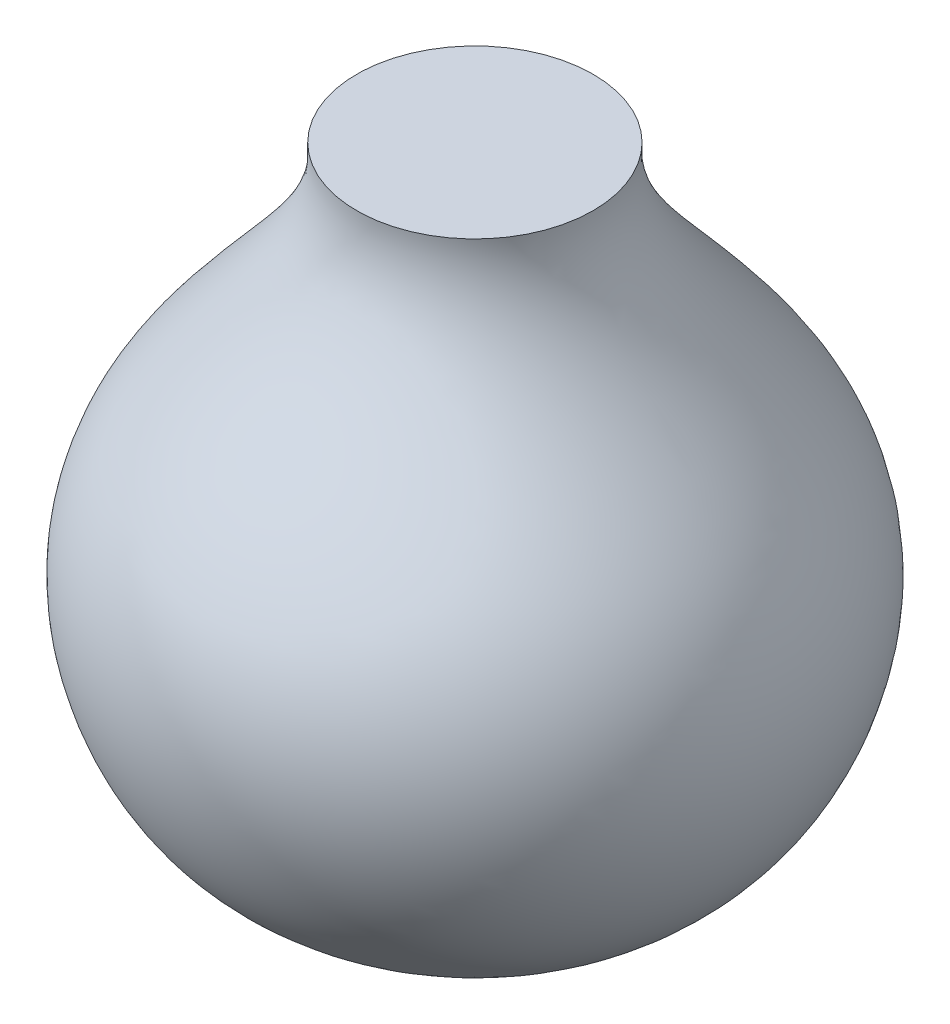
from build123d import *


with BuildPart() as part:
    # Sketch1 → Revolve1 (revolve)
    with BuildSketch(Plane.XY):
        with BuildLine():
            Line((12, 65), (0, 65))
            Line((0, 65), (0, 0))
            add(Edge.make_bspline(
                [(12, 65), (11.248467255, 55.770929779), (29.063204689, 43.595128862), (32.038403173, 25.389792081), (24.788174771, 6.859087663), (13.887180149, 0), (0, 0)],
                knots=[0, 0, 0, 0, 0.354784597, 0.60373763, 0.671371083, 1, 1, 1, 1], degree=3))
        make_face()
    revolve(axis=Axis((0, 0, 0), (0, 1, 0)))


solid = part.part
